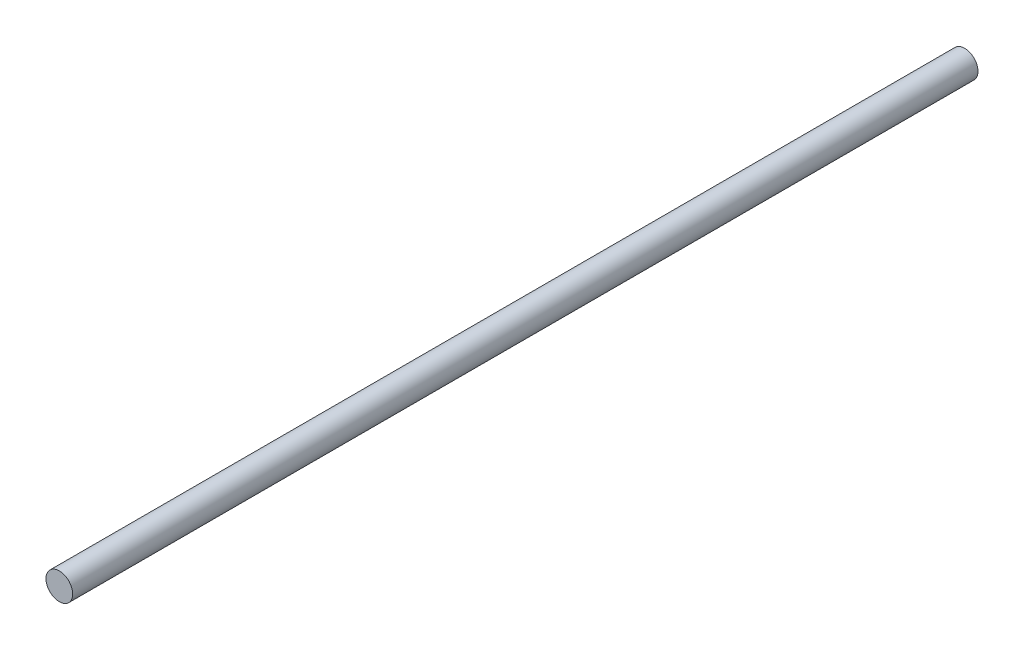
from build123d import *

# Parameters (mm, degrees)
SKETCH_1_R      = 2.95
EXTRUDE_1_DEPTH = 196
EXTRUDE_START   = 4
SKETCH_2_R      = 2.95
EXTRUDE_2_DEPTH = 4


with BuildPart() as part:
    # Sketch 1 → Extrude 1 (new body)
    with BuildSketch(Plane.XY):
        Circle(SKETCH_1_R)
    extrude(amount=-EXTRUDE_1_DEPTH)

    # Sketch 2 → Extrude 2 (add)
    with BuildSketch(Plane.XY.offset(EXTRUDE_START)):
        Circle(SKETCH_2_R)
    extrude(amount=-EXTRUDE_2_DEPTH)


solid = part.part
